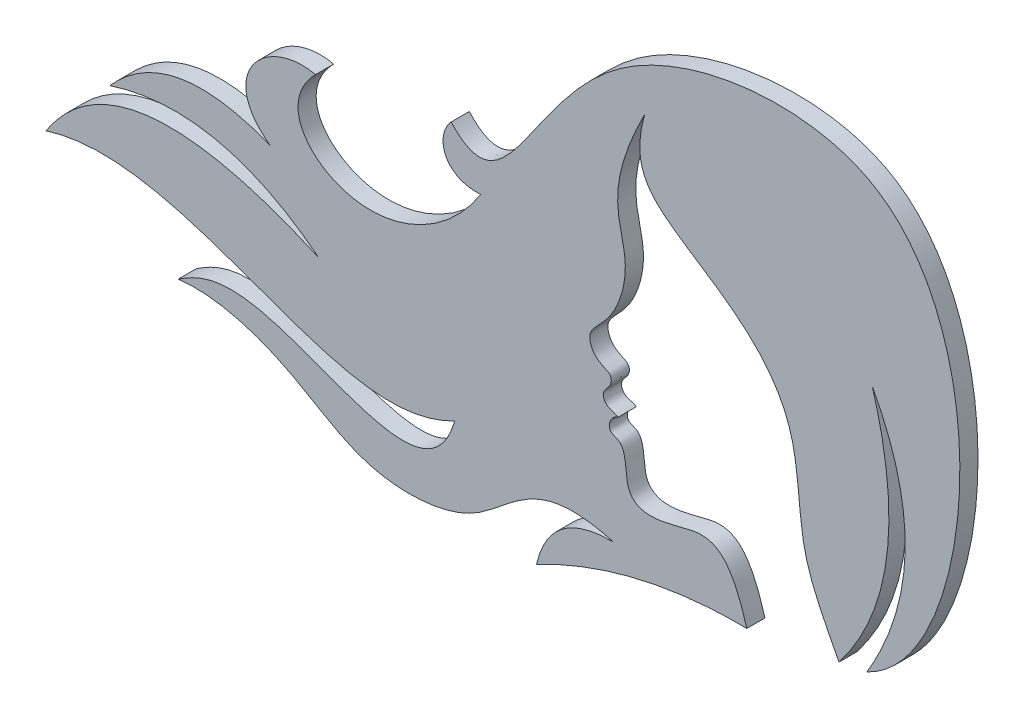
from build123d import *

# Parameters (mm, degrees)
BOSS_EXTRUDE1_DEPTH = 10


with BuildPart() as part:
    # Sketch2 → Boss-Extrude1 (new body)
    with BuildSketch(Plane.XY):
        with BuildLine():
            add(Edge.make_bspline(
                [(96.881591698, -76.95826662), (151.249906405, -51.456135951), (169.949297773, 100.000549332), (76.346292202, 179.47456072), (-80.711578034, 161.453070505), (-100.716469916, 37.136956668), (-132.148595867, 70.89845495)],
                knots=[0, 0, 0, 0, 0.421721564, 0.472247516, 0.700633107, 1, 1, 1, 1], degree=3))
            add(Edge.make_bspline(
                [(-132.148595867, 70.89845495), (-141.700592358, 60.325725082), (-135.751124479, 42.958199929), (-115.791263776, 44.551850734)],
                knots=[0, 0, 0, 0, 1, 1, 1, 1], degree=3))
            add(Edge.make_bspline(
                [(-115.791263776, 44.551850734), (-135.439486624, 13.668569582), (-193.356166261, -8.740869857), (-227.746354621, 34.90263555), (-206.820135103, 56.161277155)],
                knots=[0, 0, 0, 0, 0.521453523, 1, 1, 1, 1], degree=3))
            add(Edge.make_bspline(
                [(-206.820135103, 56.161277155), (-234.246412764, 62.330162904), (-262.813753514, 32.294608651), (-231.671562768, 9.803222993)],
                knots=[0, 0, 0, 0, 1, 1, 1, 1], degree=3))
            add(Edge.make_bspline(
                [(-231.671562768, 9.803222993), (-286.853050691, 31.945196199), (-320.133339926, -5.719311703)],
                knots=[0, 0, 0, 1, 1, 1], degree=2))
            add(Edge.make_bspline(
                [(-320.133339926, -5.719311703), (-260.532142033, 13.531515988), (-204.885519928, -30.388799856)],
                knots=[0, 0, 0, 1, 1, 1], degree=2))
            add(Edge.make_bspline(
                [(-204.885519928, -30.388799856), (-314.211220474, 18.726265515), (-355.309539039, -44.891920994)],
                knots=[0, 0, 0, 1, 1, 1], degree=2))
            add(Edge.make_bspline(
                [(-355.309539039, -44.891920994), (-281.111640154, -21.064869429), (-207.554873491, -89.76778912), (-162.853756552, -87.278049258), (-130.126908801, -70.779096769)],
                knots=[0, 0, 0, 0, 0, 1, 1, 1, 1, 1], degree=4))
            add(Edge.make_bspline(
                [(-130.126908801, -70.779096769), (-149.062899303, -135.871564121), (-228.830759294, -51.369706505), (-259.719272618, -64.238994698), (-282.507718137, -79.255424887)],
                knots=[0, 0, 0, 0, 0, 1, 1, 1, 1, 1], degree=4))
            add(Edge.make_bspline(
                [(-282.507718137, -79.255424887), (-269.85903632, -77.568044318), (-220.246837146, -85.767157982), (-188.940245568, -121.497280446), (-104.94093387, -116.747440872), (-89.003762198, -71.667832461), (-42.645499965, -84.763743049)],
                knots=[0, 0, 0, 0, 0.112722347, 0.428829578, 0.649909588, 1, 1, 1, 1], degree=3))
            add(Edge.make_bspline(
                [(-42.645499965, -84.763743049), (-77.616010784, -84.510867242), (-85.073832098, -116.568907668)],
                knots=[0, 0, 0, 1, 1, 1], degree=2))
            add(Edge.make_bspline(
                [(30.760372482, -89.268597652), (-31.056654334, -88.34684804), (-85.073832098, -116.568907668)],
                knots=[0, 0, 0, 1, 1, 1], degree=2))
            add(Edge.make_bspline(
                [(-40.040694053, -23.837880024), (-44.076132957, -25.041176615), (-46.978490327, -33.383930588), (-34.851409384, -34.601733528), (-38.406899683, -65.134441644), (-1.986209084, -60.379624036), (19.429687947, -49.669266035), (30.760372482, -89.268597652)],
                knots=[0, 0, 0, 0, 0.068245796, 0.122923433, 0.276508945, 0.562112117, 1, 1, 1, 1], degree=3))
            add(Edge.make_bspline(
                [(-25.591218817, 127.690024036), (-50.689567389, 78.383267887), (-29.051009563, 64.981750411), (-41.06097476, 22.390845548), (-56.755652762, 9.62980989), (-53.648603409, -4.298641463), (-44.045555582, -3.254287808), (-43.691571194, -11.985633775), (-49.31168024, -14.848649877), (-46.82783626, -22.811252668), (-43.259041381, -22.121428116), (-40.040694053, -23.837880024)],
                knots=[0, 0, 0, 0, 0.134508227, 0.202577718, 0.228409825, 0.238908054, 0.299932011, 0.313730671, 0.363095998, 0.376392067, 0.440520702, 0.440520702, 0.440520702, 0.440520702], degree=3))
            add(Edge.make_bspline(
                [(81.518775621, -79.935978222), (70.10663579, -58.019693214), (59.515861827, -37.739466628), (58.717449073, 45.565861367), (-11.05956814, 75.307325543), (-32.604141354, 102.806926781), (-25.591218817, 127.690024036)],
                knots=[0, 0, 0, 0, 0.197258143, 0.352609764, 0.761215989, 1, 1, 1, 1], degree=3))
            add(Edge.make_bspline(
                [(99.835240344, 60.926357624), (124.970665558, -23.842270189), (81.518775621, -79.935978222)],
                knots=[0, 0, 0, 1, 1, 1], degree=2))
            add(Edge.make_bspline(
                [(96.881591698, -76.95826662), (137.59032584, -8.768787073), (99.835240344, 60.926357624)],
                knots=[0, 0, 0, 1, 1, 1], degree=2))
        make_face()
    extrude(amount=BOSS_EXTRUDE1_DEPTH)


solid = part.part
